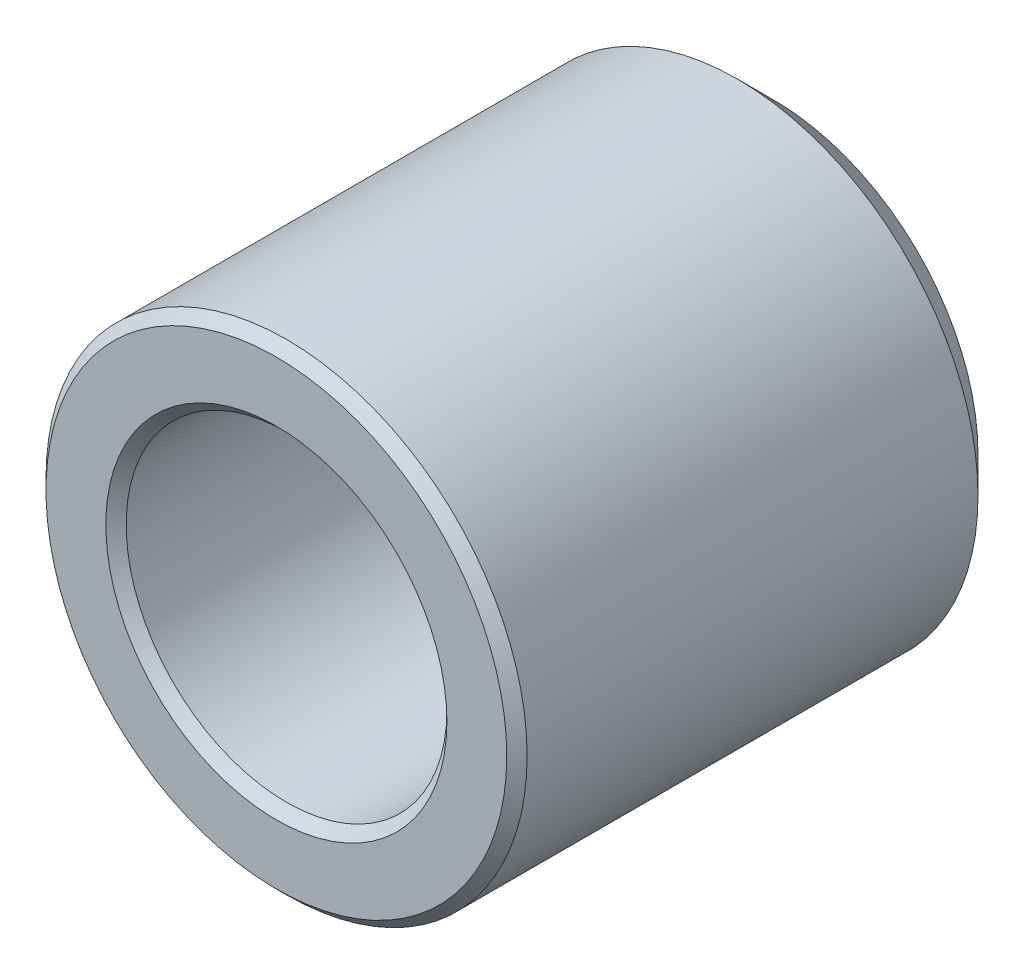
ISO-10303-21;
HEADER;
FILE_DESCRIPTION(('STEP AP214'),'2;1');
FILE_NAME('part.step','',(''),(''),'','','');
FILE_SCHEMA(('AUTOMOTIVE_DESIGN { 1 0 10303 214 1 1 1 1 }'));
ENDSEC;
DATA;
#1=APPLICATION_CONTEXT('core data for automotive mechanical design processes');
#2=APPLICATION_PROTOCOL_DEFINITION('international standard','automotive_design',2000,#1);
#3=PRODUCT_CONTEXT('',#1,'mechanical');
#4=PRODUCT('Part','Part','',(#3));
#5=PRODUCT_RELATED_PRODUCT_CATEGORY('part','',(#4));
#6=PRODUCT_DEFINITION_FORMATION('','',#4);
#7=PRODUCT_DEFINITION_CONTEXT('part definition',#1,'design');
#8=PRODUCT_DEFINITION('design','',#6,#7);
#9=PRODUCT_DEFINITION_SHAPE('','',#8);
#10=(LENGTH_UNIT() NAMED_UNIT(*) SI_UNIT(.MILLI.,.METRE.));
#11=(NAMED_UNIT(*) PLANE_ANGLE_UNIT() SI_UNIT($,.RADIAN.));
#12=(NAMED_UNIT(*) SI_UNIT($,.STERADIAN.) SOLID_ANGLE_UNIT());
#13=UNCERTAINTY_MEASURE_WITH_UNIT(LENGTH_MEASURE(1.E-05),#10,'distance_accuracy_value','');
#14=(GEOMETRIC_REPRESENTATION_CONTEXT(3) GLOBAL_UNCERTAINTY_ASSIGNED_CONTEXT((#13)) GLOBAL_UNIT_ASSIGNED_CONTEXT((#10,
#11,#12)) REPRESENTATION_CONTEXT('',''));
#15=CARTESIAN_POINT('',(0.,0.,0.));
#16=DIRECTION('',(0.,0.,1.));
#17=DIRECTION('',(1.,0.,0.));
#18=AXIS2_PLACEMENT_3D('',#15,#16,#17);
#19=CARTESIAN_POINT('',(0.,0.,12.4));
#20=DIRECTION('',(0.,0.,1.));
#21=DIRECTION('',(1.,0.,0.));
#22=AXIS2_PLACEMENT_3D('',#19,#20,#21);
#23=CYLINDRICAL_SURFACE('',#22,2.25);
#24=CARTESIAN_POINT('',(0.,0.,0.25));
#25=DIRECTION('',(0.,0.,1.));
#26=DIRECTION('',(1.,0.,0.));
#27=AXIS2_PLACEMENT_3D('',#24,#25,#26);
#28=CIRCLE('',#27,2.25);
#29=CARTESIAN_POINT('',(2.25,0.,0.25));
#30=VERTEX_POINT('',#29);
#31=EDGE_CURVE('E8',#30,#30,#28,.F.);
#32=ORIENTED_EDGE('',*,*,#31,.T.);
#33=EDGE_LOOP('',(#32));
#34=FACE_BOUND('',#33,.T.);
#35=CARTESIAN_POINT('',(0.,0.,6.4));
#36=DIRECTION('',(0.,0.,1.));
#37=DIRECTION('',(1.,0.,0.));
#38=AXIS2_PLACEMENT_3D('',#35,#36,#37);
#39=CIRCLE('',#38,2.25);
#40=CARTESIAN_POINT('',(2.25,0.,6.4));
#41=VERTEX_POINT('',#40);
#42=EDGE_CURVE('E33',#41,#41,#39,.F.);
#43=ORIENTED_EDGE('',*,*,#42,.F.);
#44=EDGE_LOOP('',(#43));
#45=FACE_BOUND('',#44,.T.);
#46=ADVANCED_FACE('F12',(#34,#45),#23,.F.);
#47=CARTESIAN_POINT('',(0.,0.,2.4));
#48=DIRECTION('',(0.,0.,1.));
#49=DIRECTION('',(1.,0.,0.));
#50=AXIS2_PLACEMENT_3D('',#47,#48,#49);
#51=CYLINDRICAL_SURFACE('',#50,6.);
#52=CARTESIAN_POINT('',(0.,0.,0.9));
#53=DIRECTION('',(0.,0.,1.));
#54=DIRECTION('',(1.,0.,0.));
#55=AXIS2_PLACEMENT_3D('',#52,#53,#54);
#56=CIRCLE('',#55,6.);
#57=CARTESIAN_POINT('',(6.,0.,0.9));
#58=VERTEX_POINT('',#57);
#59=EDGE_CURVE('E27',#58,#58,#56,.T.);
#60=ORIENTED_EDGE('',*,*,#59,.T.);
#61=EDGE_LOOP('',(#60));
#62=FACE_BOUND('',#61,.T.);
#63=CARTESIAN_POINT('',(0.,0.,12.146));
#64=DIRECTION('',(0.,0.,1.));
#65=DIRECTION('',(1.,0.,0.));
#66=AXIS2_PLACEMENT_3D('',#63,#64,#65);
#67=CIRCLE('',#66,6.);
#68=CARTESIAN_POINT('',(6.,0.,12.146));
#69=VERTEX_POINT('',#68);
#70=EDGE_CURVE('E43',#69,#69,#67,.F.);
#71=ORIENTED_EDGE('',*,*,#70,.T.);
#72=EDGE_LOOP('',(#71));
#73=FACE_BOUND('',#72,.T.);
#74=ADVANCED_FACE('F73',(#62,#73),#51,.T.);
#75=CARTESIAN_POINT('',(0.,0.,12.4));
#76=DIRECTION('',(0.,0.,1.));
#77=DIRECTION('',(1.,0.,0.));
#78=AXIS2_PLACEMENT_3D('',#75,#76,#77);
#79=PLANE('',#78);
#80=CARTESIAN_POINT('',(0.,0.,12.4));
#81=DIRECTION('',(0.,0.,1.));
#82=DIRECTION('',(1.,0.,0.));
#83=AXIS2_PLACEMENT_3D('',#80,#81,#82);
#84=CIRCLE('',#83,4.254);
#85=CARTESIAN_POINT('',(4.254,0.,12.4));
#86=VERTEX_POINT('',#85);
#87=EDGE_CURVE('E32',#86,#86,#84,.F.);
#88=ORIENTED_EDGE('',*,*,#87,.T.);
#89=EDGE_LOOP('',(#88));
#90=FACE_BOUND('',#89,.T.);
#91=CARTESIAN_POINT('',(0.,0.,12.4));
#92=DIRECTION('',(0.,0.,1.));
#93=DIRECTION('',(1.,0.,0.));
#94=AXIS2_PLACEMENT_3D('',#91,#92,#93);
#95=CIRCLE('',#94,5.746);
#96=CARTESIAN_POINT('',(5.746,0.,12.4));
#97=VERTEX_POINT('',#96);
#98=EDGE_CURVE('E36',#97,#97,#95,.T.);
#99=ORIENTED_EDGE('',*,*,#98,.T.);
#100=EDGE_LOOP('',(#99));
#101=FACE_BOUND('',#100,.T.);
#102=ADVANCED_FACE('F67',(#90,#101),#79,.T.);
#103=CARTESIAN_POINT('',(0.,0.,12.4));
#104=DIRECTION('',(0.,0.,-1.));
#105=DIRECTION('',(-1.,0.,0.));
#106=AXIS2_PLACEMENT_3D('',#103,#104,#105);
#107=CONICAL_SURFACE('',#106,5.746,0.78539816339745);
#108=ORIENTED_EDGE('',*,*,#70,.F.);
#109=EDGE_LOOP('',(#108));
#110=FACE_BOUND('',#109,.T.);
#111=ORIENTED_EDGE('',*,*,#98,.F.);
#112=EDGE_LOOP('',(#111));
#113=FACE_BOUND('',#112,.T.);
#114=ADVANCED_FACE('F57',(#110,#113),#107,.T.);
#115=CARTESIAN_POINT('',(0.,0.,12.4));
#116=DIRECTION('',(0.,0.,1.));
#117=DIRECTION('',(1.,0.,0.));
#118=AXIS2_PLACEMENT_3D('',#115,#116,#117);
#119=CYLINDRICAL_SURFACE('',#118,4.);
#120=CARTESIAN_POINT('',(0.,0.,12.146));
#121=DIRECTION('',(0.,0.,1.));
#122=DIRECTION('',(1.,0.,0.));
#123=AXIS2_PLACEMENT_3D('',#120,#121,#122);
#124=CIRCLE('',#123,4.);
#125=CARTESIAN_POINT('',(4.,0.,12.146));
#126=VERTEX_POINT('',#125);
#127=EDGE_CURVE('E40',#126,#126,#124,.T.);
#128=ORIENTED_EDGE('',*,*,#127,.T.);
#129=EDGE_LOOP('',(#128));
#130=FACE_BOUND('',#129,.T.);
#131=CARTESIAN_POINT('',(0.,0.,6.4));
#132=DIRECTION('',(0.,0.,1.));
#133=DIRECTION('',(1.,0.,0.));
#134=AXIS2_PLACEMENT_3D('',#131,#132,#133);
#135=CIRCLE('',#134,4.);
#136=CARTESIAN_POINT('',(4.,0.,6.4));
#137=VERTEX_POINT('',#136);
#138=EDGE_CURVE('E37',#137,#137,#135,.T.);
#139=ORIENTED_EDGE('',*,*,#138,.F.);
#140=EDGE_LOOP('',(#139));
#141=FACE_BOUND('',#140,.T.);
#142=ADVANCED_FACE('F54',(#130,#141),#119,.F.);
#143=CARTESIAN_POINT('',(0.,0.,12.146));
#144=DIRECTION('',(0.,0.,1.));
#145=DIRECTION('',(1.,0.,0.));
#146=AXIS2_PLACEMENT_3D('',#143,#144,#145);
#147=CONICAL_SURFACE('',#146,4.,0.785398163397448);
#148=ORIENTED_EDGE('',*,*,#87,.F.);
#149=EDGE_LOOP('',(#148));
#150=FACE_BOUND('',#149,.T.);
#151=ORIENTED_EDGE('',*,*,#127,.F.);
#152=EDGE_LOOP('',(#151));
#153=FACE_BOUND('',#152,.T.);
#154=ADVANCED_FACE('F56',(#150,#153),#147,.F.);
#155=CARTESIAN_POINT('',(0.,0.,6.4));
#156=DIRECTION('',(0.,0.,1.));
#157=DIRECTION('',(1.,0.,0.));
#158=AXIS2_PLACEMENT_3D('',#155,#156,#157);
#159=PLANE('',#158);
#160=ORIENTED_EDGE('',*,*,#138,.T.);
#161=EDGE_LOOP('',(#160));
#162=FACE_BOUND('',#161,.T.);
#163=ORIENTED_EDGE('',*,*,#42,.T.);
#164=EDGE_LOOP('',(#163));
#165=FACE_BOUND('',#164,.T.);
#166=ADVANCED_FACE('F51',(#162,#165),#159,.T.);
#167=CARTESIAN_POINT('',(0.,0.,0.));
#168=DIRECTION('',(0.,0.,1.));
#169=DIRECTION('',(1.,0.,0.));
#170=AXIS2_PLACEMENT_3D('',#167,#168,#169);
#171=PLANE('',#170);
#172=CARTESIAN_POINT('',(0.,0.,0.));
#173=DIRECTION('',(0.,0.,1.));
#174=DIRECTION('',(1.,0.,0.));
#175=AXIS2_PLACEMENT_3D('',#172,#173,#174);
#176=CIRCLE('',#175,2.5);
#177=CARTESIAN_POINT('',(2.5,0.,0.));
#178=VERTEX_POINT('',#177);
#179=EDGE_CURVE('E19',#178,#178,#176,.T.);
#180=ORIENTED_EDGE('',*,*,#179,.T.);
#181=EDGE_LOOP('',(#180));
#182=FACE_BOUND('',#181,.T.);
#183=CARTESIAN_POINT('',(0.,0.,0.));
#184=DIRECTION('',(0.,0.,1.));
#185=DIRECTION('',(1.,0.,0.));
#186=AXIS2_PLACEMENT_3D('',#183,#184,#185);
#187=CIRCLE('',#186,5.1);
#188=CARTESIAN_POINT('',(5.1,0.,0.));
#189=VERTEX_POINT('',#188);
#190=EDGE_CURVE('E23',#189,#189,#187,.F.);
#191=ORIENTED_EDGE('',*,*,#190,.T.);
#192=EDGE_LOOP('',(#191));
#193=FACE_BOUND('',#192,.T.);
#194=ADVANCED_FACE('F85',(#182,#193),#171,.F.);
#195=CARTESIAN_POINT('',(0.,0.,0.9));
#196=DIRECTION('',(0.,0.,1.));
#197=DIRECTION('',(1.,0.,0.));
#198=AXIS2_PLACEMENT_3D('',#195,#196,#197);
#199=CONICAL_SURFACE('',#198,6.,0.785398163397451);
#200=ORIENTED_EDGE('',*,*,#190,.F.);
#201=EDGE_LOOP('',(#200));
#202=FACE_BOUND('',#201,.T.);
#203=ORIENTED_EDGE('',*,*,#59,.F.);
#204=EDGE_LOOP('',(#203));
#205=FACE_BOUND('',#204,.T.);
#206=ADVANCED_FACE('F83',(#202,#205),#199,.T.);
#207=CARTESIAN_POINT('',(0.,0.,0.));
#208=DIRECTION('',(0.,0.,-1.));
#209=DIRECTION('',(-1.,0.,0.));
#210=AXIS2_PLACEMENT_3D('',#207,#208,#209);
#211=CONICAL_SURFACE('',#210,2.5,0.785398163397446);
#212=ORIENTED_EDGE('',*,*,#31,.F.);
#213=EDGE_LOOP('',(#212));
#214=FACE_BOUND('',#213,.T.);
#215=ORIENTED_EDGE('',*,*,#179,.F.);
#216=EDGE_LOOP('',(#215));
#217=FACE_BOUND('',#216,.T.);
#218=ADVANCED_FACE('F14',(#214,#217),#211,.F.);
#219=CLOSED_SHELL('',(#46,#74,#102,#114,#142,#154,#166,#194,#206,#218));
#220=MANIFOLD_SOLID_BREP('B1',#219);
#221=ADVANCED_BREP_SHAPE_REPRESENTATION('',(#18,#220),#14);
#222=SHAPE_DEFINITION_REPRESENTATION(#9,#221);
ENDSEC;
END-ISO-10303-21;
